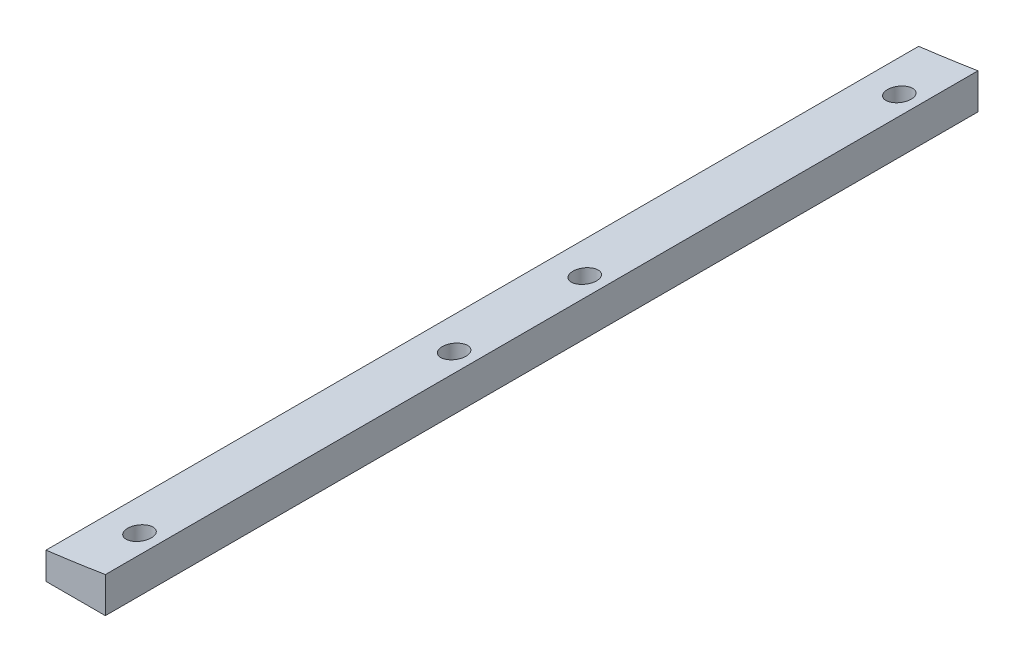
from build123d import *

# Parameters (mm, degrees)
EXTRUSION1_DEPTH              = 294
DIAM_TRE_DU_PER_AGE_8_0_8_1_D = 8


with BuildPart() as part:
    # Esquisse1 → Extrusion1 (new body)
    with BuildSketch(Plane.XY):
        with BuildLine():
            Line((75, -14.600946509), (95, -14.600946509))
            Line((95, -14.600946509), (95, -2.600946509))
            ThreePointArc((95, -2.600946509), (85.012049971, -4.116442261), (75, -5.463560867))
            Line((75, -5.463560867), (75, -14.600946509))
        make_face()
    extrude(amount=EXTRUSION1_DEPTH)

    # Diam_tre du per_age _8.0 _8_1 (through all)
    with Locations(Plane.XZ.offset(14.600946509)):
        with Locations((87.5, 169), (87.5, 19), (87.5, 275), (87.5, 125)):
            Hole(DIAM_TRE_DU_PER_AGE_8_0_8_1_D / 2)


solid = part.part
